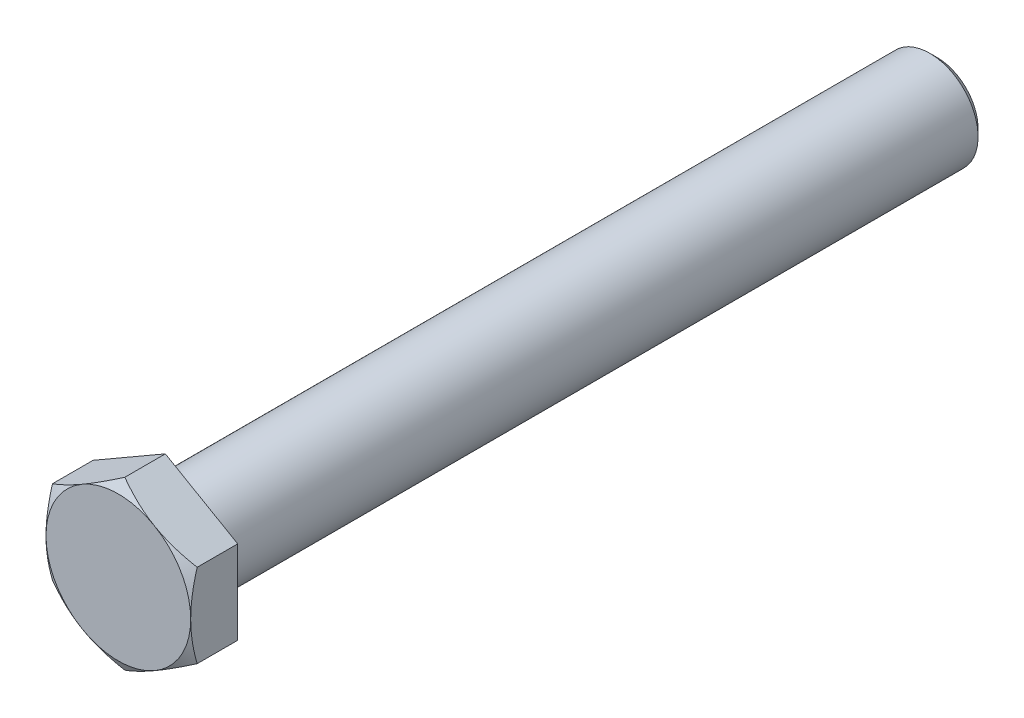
ISO-10303-21;
HEADER;
FILE_DESCRIPTION(('STEP AP214'),'2;1');
FILE_NAME('part.step','',(''),(''),'','','');
FILE_SCHEMA(('AUTOMOTIVE_DESIGN { 1 0 10303 214 1 1 1 1 }'));
ENDSEC;
DATA;
#1=APPLICATION_CONTEXT('core data for automotive mechanical design processes');
#2=APPLICATION_PROTOCOL_DEFINITION('international standard','automotive_design',2000,#1);
#3=PRODUCT_CONTEXT('',#1,'mechanical');
#4=PRODUCT('Part','Part','',(#3));
#5=PRODUCT_RELATED_PRODUCT_CATEGORY('part','',(#4));
#6=PRODUCT_DEFINITION_FORMATION('','',#4);
#7=PRODUCT_DEFINITION_CONTEXT('part definition',#1,'design');
#8=PRODUCT_DEFINITION('design','',#6,#7);
#9=PRODUCT_DEFINITION_SHAPE('','',#8);
#10=(LENGTH_UNIT() NAMED_UNIT(*) SI_UNIT(.MILLI.,.METRE.));
#11=(NAMED_UNIT(*) PLANE_ANGLE_UNIT() SI_UNIT($,.RADIAN.));
#12=(NAMED_UNIT(*) SI_UNIT($,.STERADIAN.) SOLID_ANGLE_UNIT());
#13=UNCERTAINTY_MEASURE_WITH_UNIT(LENGTH_MEASURE(1.E-05),#10,'distance_accuracy_value','');
#14=(GEOMETRIC_REPRESENTATION_CONTEXT(3) GLOBAL_UNCERTAINTY_ASSIGNED_CONTEXT((#13)) GLOBAL_UNIT_ASSIGNED_CONTEXT((#10,
#11,#12)) REPRESENTATION_CONTEXT('',''));
#15=CARTESIAN_POINT('',(0.,0.,0.));
#16=DIRECTION('',(0.,0.,1.));
#17=DIRECTION('',(1.,0.,0.));
#18=AXIS2_PLACEMENT_3D('',#15,#16,#17);
#19=CARTESIAN_POINT('',(0.,-27.4963065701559,46.5125483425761));
#20=DIRECTION('',(0.5,-0.866025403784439,0.));
#21=DIRECTION('',(0.866025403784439,0.5,0.));
#22=AXIS2_PLACEMENT_3D('',#19,#20,#21);
#23=PLANE('',#22);
#24=DIRECTION('',(0.,0.,1.));
#25=VECTOR('',#24,1.);
#26=CARTESIAN_POINT('',(23.8125,-13.748153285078,46.5125483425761));
#27=LINE('',#26,#25);
#28=CARTESIAN_POINT('',(23.8125,-13.748153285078,119.2609375));
#29=VERTEX_POINT('',#28);
#30=CARTESIAN_POINT('',(23.8125,-13.748153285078,132.612215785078));
#31=VERTEX_POINT('',#30);
#32=EDGE_CURVE('E159',#29,#31,#27,.T.);
#33=ORIENTED_EDGE('',*,*,#32,.T.);
#34=CARTESIAN_POINT('',(23.8127,-13.7480378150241,132.612149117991));
#35=CARTESIAN_POINT('',(23.2893115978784,-14.0502162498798,132.78659920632));
#36=CARTESIAN_POINT('',(22.7638817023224,-14.3535733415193,132.953132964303));
#37=CARTESIAN_POINT('',(21.7088085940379,-14.9627200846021,133.2681673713));
#38=CARTESIAN_POINT('',(21.1791640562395,-15.2685105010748,133.416662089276));
#39=CARTESIAN_POINT('',(20.1146267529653,-15.8831213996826,133.693625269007));
#40=CARTESIAN_POINT('',(19.5797245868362,-16.1919473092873,133.822045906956));
#41=CARTESIAN_POINT('',(18.5062261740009,-16.8117319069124,134.05609444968));
#42=CARTESIAN_POINT('',(17.9676303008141,-17.1226903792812,134.16172462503));
#43=CARTESIAN_POINT('',(16.9005114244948,-17.7387917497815,134.345708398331));
#44=CARTESIAN_POINT('',(16.3720675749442,-18.0438889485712,134.424670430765));
#45=CARTESIAN_POINT('',(15.3127585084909,-18.655481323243,134.557071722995));
#46=CARTESIAN_POINT('',(14.7818932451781,-18.9619765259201,134.610510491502));
#47=CARTESIAN_POINT('',(13.719270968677,-19.5754817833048,134.69051595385));
#48=CARTESIAN_POINT('',(13.1875157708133,-19.8824907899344,134.717114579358));
#49=CARTESIAN_POINT('',(12.1235146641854,-20.4967921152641,134.742867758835));
#50=CARTESIAN_POINT('',(11.5912687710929,-20.8040844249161,134.742023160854));
#51=CARTESIAN_POINT('',(10.5962267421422,-21.3785722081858,134.714806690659));
#52=CARTESIAN_POINT('',(10.1333597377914,-21.6458085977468,134.691753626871));
#53=CARTESIAN_POINT('',(9.20873076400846,-22.1796433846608,134.625329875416));
#54=CARTESIAN_POINT('',(8.74696877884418,-22.446241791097,134.58195947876));
#55=CARTESIAN_POINT('',(7.82472045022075,-22.9787021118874,134.475652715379));
#56=CARTESIAN_POINT('',(7.3642356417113,-23.2445631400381,134.412698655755));
#57=CARTESIAN_POINT('',(6.44547090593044,-23.7750122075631,134.268338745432));
#58=CARTESIAN_POINT('',(5.98719096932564,-24.0396002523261,134.18693297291));
#59=CARTESIAN_POINT('',(4.59595069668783,-24.842833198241,133.912948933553));
#60=CARTESIAN_POINT('',(3.66694311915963,-25.3791959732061,133.693036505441));
#61=CARTESIAN_POINT('',(2.28369123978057,-26.1778168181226,133.318645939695));
#62=CARTESIAN_POINT('',(1.82471356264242,-26.4428077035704,133.186563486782));
#63=CARTESIAN_POINT('',(0.909932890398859,-26.9709565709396,132.909026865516));
#64=CARTESIAN_POINT('',(0.454129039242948,-27.2341150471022,132.763576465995));
#65=CARTESIAN_POINT('',(-0.000200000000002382,-27.4964220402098,132.612149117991));
#66=B_SPLINE_CURVE_WITH_KNOTS('',3,(#34,#35,#36,#37,#38,#39,#40,#41,#42,#43,#44,#45,#46,#47,#48,
#49,#50,#51,#52,#53,#54,#55,#56,#57,#58,#59,#60,#61,#62,#63,#64,#65),.UNSPECIFIED.,.F.,.F.,(4,2,
2,2,2,2,2,2,2,2,2,2,2,2,2,4),(0.,1.88714251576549,3.77490383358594,5.66709611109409,
7.55909978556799,9.40444412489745,11.2498239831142,13.093005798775,14.9361306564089,
16.5406522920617,18.1451509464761,19.7511034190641,21.3570490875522,24.6396796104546,
26.2781355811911,27.9161310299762),.UNSPECIFIED.);
#67=CARTESIAN_POINT('',(11.90625,-20.6222299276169,134.7390625));
#68=VERTEX_POINT('',#67);
#69=EDGE_CURVE('E278',#31,#68,#66,.T.);
#70=ORIENTED_EDGE('',*,*,#69,.T.);
#71=CARTESIAN_POINT('',(0.,-27.4963065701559,132.612215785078));
#72=VERTEX_POINT('',#71);
#73=EDGE_CURVE('E202',#68,#72,#66,.T.);
#74=ORIENTED_EDGE('',*,*,#73,.T.);
#75=DIRECTION('',(0.,0.,1.));
#76=VECTOR('',#75,1.);
#77=CARTESIAN_POINT('',(0.,-27.4963065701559,46.5125483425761));
#78=LINE('',#77,#76);
#79=CARTESIAN_POINT('',(0.,-27.4963065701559,119.2609375));
#80=VERTEX_POINT('',#79);
#81=EDGE_CURVE('E303',#80,#72,#78,.T.);
#82=ORIENTED_EDGE('',*,*,#81,.F.);
#83=DIRECTION('',(0.866025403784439,0.5,0.));
#84=VECTOR('',#83,1.);
#85=CARTESIAN_POINT('',(0.,-27.4963065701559,119.2609375));
#86=LINE('',#85,#84);
#87=EDGE_CURVE('E157',#80,#29,#86,.T.);
#88=ORIENTED_EDGE('',*,*,#87,.T.);
#89=EDGE_LOOP('',(#33,#70,#74,#82,#88));
#90=FACE_BOUND('',#89,.T.);
#91=ADVANCED_FACE('F46',(#90),#23,.T.);
#92=CARTESIAN_POINT('',(23.8125,-13.748153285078,46.5125483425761));
#93=DIRECTION('',(1.,0.,0.));
#94=DIRECTION('',(0.,0.,-1.));
#95=AXIS2_PLACEMENT_3D('',#92,#93,#94);
#96=PLANE('',#95);
#97=DIRECTION('',(0.,0.,1.));
#98=VECTOR('',#97,1.);
#99=CARTESIAN_POINT('',(23.8125,13.748153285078,46.5125483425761));
#100=LINE('',#99,#98);
#101=CARTESIAN_POINT('',(23.8125,13.748153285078,119.2609375));
#102=VERTEX_POINT('',#101);
#103=CARTESIAN_POINT('',(23.8125,13.748153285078,132.612215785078));
#104=VERTEX_POINT('',#103);
#105=EDGE_CURVE('E320',#102,#104,#100,.T.);
#106=ORIENTED_EDGE('',*,*,#105,.T.);
#107=CARTESIAN_POINT('',(23.8125,-37.2463217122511,122.963869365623));
#108=CARTESIAN_POINT('',(23.8125,-36.7248950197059,123.217502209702));
#109=CARTESIAN_POINT('',(23.8125,-36.2028645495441,123.469897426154));
#110=CARTESIAN_POINT('',(23.8125,-35.1574708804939,123.971925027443));
#111=CARTESIAN_POINT('',(23.8125,-34.6341076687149,124.221557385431));
#112=CARTESIAN_POINT('',(23.8125,-33.5858549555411,124.717803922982));
#113=CARTESIAN_POINT('',(23.8125,-33.0609652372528,124.964417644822));
#114=CARTESIAN_POINT('',(23.8125,-32.0096028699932,125.454242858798));
#115=CARTESIAN_POINT('',(23.8125,-31.4831302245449,125.6974543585));
#116=CARTESIAN_POINT('',(23.8125,-29.8955348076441,126.42397750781));
#117=CARTESIAN_POINT('',(23.8125,-28.8317732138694,126.901546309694));
#118=CARTESIAN_POINT('',(23.8125,-26.6958950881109,127.837581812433));
#119=CARTESIAN_POINT('',(23.8125,-25.6237789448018,128.296049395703));
#120=CARTESIAN_POINT('',(23.8125,-23.9903137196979,128.972940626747));
#121=CARTESIAN_POINT('',(23.8125,-23.4326424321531,129.200247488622));
#122=CARTESIAN_POINT('',(23.8125,-22.3143641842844,129.647512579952));
#123=CARTESIAN_POINT('',(23.8125,-21.7537572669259,129.867470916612));
#124=CARTESIAN_POINT('',(23.8125,-20.6292564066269,130.299078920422));
#125=CARTESIAN_POINT('',(23.8125,-20.0653620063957,130.510727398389));
#126=CARTESIAN_POINT('',(23.8125,-18.9341081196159,130.92452722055));
#127=CARTESIAN_POINT('',(23.8125,-18.3667487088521,131.126678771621));
#128=CARTESIAN_POINT('',(23.8125,-17.2294024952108,131.519792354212));
#129=CARTESIAN_POINT('',(23.8125,-16.6594230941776,131.710775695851));
#130=CARTESIAN_POINT('',(23.8125,-15.5155155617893,132.080490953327));
#131=CARTESIAN_POINT('',(23.8125,-14.9415873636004,132.25922266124));
#132=CARTESIAN_POINT('',(23.8125,-13.2138318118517,132.774511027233));
#133=CARTESIAN_POINT('',(23.8125,-12.0536072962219,133.090310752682));
#134=CARTESIAN_POINT('',(23.8125,-10.3038688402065,133.510278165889));
#135=CARTESIAN_POINT('',(23.8125,-9.72067055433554,133.641025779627));
#136=CARTESIAN_POINT('',(23.8125,-8.55022632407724,133.883073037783));
#137=CARTESIAN_POINT('',(23.8125,-7.96298045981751,133.994373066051));
#138=CARTESIAN_POINT('',(23.8125,-6.78484275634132,134.195578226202));
#139=CARTESIAN_POINT('',(23.8125,-6.19395106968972,134.285484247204));
#140=CARTESIAN_POINT('',(23.8125,-5.00908317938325,134.442126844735));
#141=CARTESIAN_POINT('',(23.8125,-4.41510697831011,134.508863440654));
#142=CARTESIAN_POINT('',(23.8125,-3.23283276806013,134.616980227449));
#143=CARTESIAN_POINT('',(23.8125,-2.64456480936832,134.658687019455));
#144=CARTESIAN_POINT('',(23.8125,-1.4667922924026,134.717170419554));
#145=CARTESIAN_POINT('',(23.8125,-0.877287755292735,134.73394745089));
#146=CARTESIAN_POINT('',(23.8125,0.301907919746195,134.742170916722));
#147=CARTESIAN_POINT('',(23.8125,0.891599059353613,134.733617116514));
#148=CARTESIAN_POINT('',(23.8125,2.07008842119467,134.691390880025));
#149=CARTESIAN_POINT('',(23.8125,2.65888660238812,134.657717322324));
#150=CARTESIAN_POINT('',(23.8125,4.06417520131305,134.548093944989));
#151=CARTESIAN_POINT('',(23.8125,4.87979460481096,134.460770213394));
#152=CARTESIAN_POINT('',(23.8125,6.50519459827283,134.242600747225));
#153=CARTESIAN_POINT('',(23.8125,7.31497441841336,134.11174937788));
#154=CARTESIAN_POINT('',(23.8125,8.92783755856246,133.811178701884));
#155=CARTESIAN_POINT('',(23.8125,9.73091548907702,133.641430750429));
#156=CARTESIAN_POINT('',(23.8125,11.3291239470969,133.268260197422));
#157=CARTESIAN_POINT('',(23.8125,12.1242545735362,133.064838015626));
#158=CARTESIAN_POINT('',(23.8125,13.7248372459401,132.624262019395));
#159=CARTESIAN_POINT('',(23.8125,14.5301034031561,132.38643753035));
#160=CARTESIAN_POINT('',(23.8125,16.1327036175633,131.885556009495));
#161=CARTESIAN_POINT('',(23.8125,16.9300376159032,131.622498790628));
#162=CARTESIAN_POINT('',(23.8125,18.5171718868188,131.075384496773));
#163=CARTESIAN_POINT('',(23.8125,19.3069743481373,130.791333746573));
#164=CARTESIAN_POINT('',(23.8125,20.4867238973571,130.352066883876));
#165=CARTESIAN_POINT('',(23.8125,20.8791465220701,130.203446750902));
#166=CARTESIAN_POINT('',(23.8125,21.6624430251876,129.902174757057));
#167=CARTESIAN_POINT('',(23.8125,22.0533169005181,129.749522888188));
#168=CARTESIAN_POINT('',(23.8125,23.0793859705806,129.343209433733));
#169=CARTESIAN_POINT('',(23.8125,23.7133734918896,129.086496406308));
#170=CARTESIAN_POINT('',(23.8125,24.9778550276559,128.564590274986));
#171=CARTESIAN_POINT('',(23.8125,25.6083489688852,128.299396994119));
#172=CARTESIAN_POINT('',(23.8125,26.8662295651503,127.761621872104));
#173=CARTESIAN_POINT('',(23.8125,27.4936159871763,127.489039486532));
#174=CARTESIAN_POINT('',(23.8125,28.7455556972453,126.937438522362));
#175=CARTESIAN_POINT('',(23.8125,29.3701089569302,126.658419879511));
#176=CARTESIAN_POINT('',(23.8125,31.2403678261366,125.812758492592));
#177=CARTESIAN_POINT('',(23.8125,32.4822645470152,125.237685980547));
#178=CARTESIAN_POINT('',(23.8125,34.957785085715,124.070192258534));
#179=CARTESIAN_POINT('',(23.8125,36.1914091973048,123.477771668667));
#180=CARTESIAN_POINT('',(23.8125,38.6537975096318,122.27835070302));
#181=CARTESIAN_POINT('',(23.8125,39.8825518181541,121.671330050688));
#182=CARTESIAN_POINT('',(23.8125,42.3345841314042,120.44632415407));
#183=CARTESIAN_POINT('',(23.8125,43.5578620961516,119.828338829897));
#184=CARTESIAN_POINT('',(23.8125,45.9996546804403,118.583620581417));
#185=CARTESIAN_POINT('',(23.8125,47.2181701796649,117.956889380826));
#186=CARTESIAN_POINT('',(23.8125,49.6514328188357,116.696169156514));
#187=CARTESIAN_POINT('',(23.8125,50.8661799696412,116.062180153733));
#188=CARTESIAN_POINT('',(23.8125,53.1699764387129,114.85253135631));
#189=CARTESIAN_POINT('',(23.8125,54.2593287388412,114.277448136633));
#190=CARTESIAN_POINT('',(23.8125,56.435836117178,113.123137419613));
#191=CARTESIAN_POINT('',(23.8125,57.5229911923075,112.543909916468));
#192=CARTESIAN_POINT('',(23.8125,60.781735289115,110.800864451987));
#193=CARTESIAN_POINT('',(23.8125,62.9504888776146,109.63174372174));
#194=CARTESIAN_POINT('',(23.8125,66.1959023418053,107.871961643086));
#195=CARTESIAN_POINT('',(23.8125,67.2747258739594,107.285280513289));
#196=CARTESIAN_POINT('',(23.8125,69.4311082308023,106.109596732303));
#197=CARTESIAN_POINT('',(23.8125,70.5086670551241,105.520594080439));
#198=CARTESIAN_POINT('',(23.8125,72.6625918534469,104.340597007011));
#199=CARTESIAN_POINT('',(23.8125,73.7389579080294,103.749602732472));
#200=CARTESIAN_POINT('',(23.8125,75.8906951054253,102.565808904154));
#201=CARTESIAN_POINT('',(23.8125,76.9660662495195,101.973009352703));
#202=CARTESIAN_POINT('',(23.8125,78.0410012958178,101.379420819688));
#203=B_SPLINE_CURVE_WITH_KNOTS('',3,(#107,#108,#109,#110,#111,#112,#113,#114,#115,#116,#117,
#118,#119,#120,#121,#122,#123,#124,#125,#126,#127,#128,#129,#130,#131,#132,#133,#134,#135,#136,
#137,#138,#139,#140,#141,#142,#143,#144,#145,#146,#147,#148,#149,#150,#151,#152,#153,#154,#155,
#156,#157,#158,#159,#160,#161,#162,#163,#164,#165,#166,#167,#168,#169,#170,#171,#172,#173,#174,
#175,#176,#177,#178,#179,#180,#181,#182,#183,#184,#185,#186,#187,#188,#189,#190,#191,#192,#193,
#194,#195,#196,#197,#198,#199,#200,#201,#202),.UNSPECIFIED.,.F.,.F.,(4,2,2,2,2,2,2,2,2,2,2,2,2,
2,2,2,2,2,2,2,2,2,2,2,2,2,2,2,2,2,2,2,2,2,2,2,2,2,2,2,2,2,2,2,2,2,2,4),(0.,1.73952319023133,
3.47906327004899,5.21886393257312,6.95866072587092,10.4566487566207,13.9544750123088,
15.7610845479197,17.5676677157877,19.3745084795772,21.1813098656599,22.9845429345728,
24.7878065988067,28.3929796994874,30.1857435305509,31.9784719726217,33.7711258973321,
35.5637783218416,37.3324998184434,39.1011912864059,40.8698991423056,42.6386859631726,
45.0981752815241,47.5579831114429,50.0196082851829,52.4812027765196,54.9996623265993,
57.5181405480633,60.0358630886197,61.2947144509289,62.553568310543,64.6054608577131,
66.6573962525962,68.70948324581,70.7615907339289,74.8671380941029,78.9725388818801,
83.0840144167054,87.1955199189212,91.3062262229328,95.4169206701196,99.1124053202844,
102.807895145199,110.199262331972,113.883347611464,117.56743395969,121.251254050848,
124.935069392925),.UNSPECIFIED.);
#204=CARTESIAN_POINT('',(23.8125,0.,134.7390625));
#205=VERTEX_POINT('',#204);
#206=EDGE_CURVE('E121',#104,#205,#203,.F.);
#207=ORIENTED_EDGE('',*,*,#206,.T.);
#208=EDGE_CURVE('E170',#205,#31,#203,.F.);
#209=ORIENTED_EDGE('',*,*,#208,.T.);
#210=ORIENTED_EDGE('',*,*,#32,.F.);
#211=DIRECTION('',(0.,1.,0.));
#212=VECTOR('',#211,1.);
#213=CARTESIAN_POINT('',(23.8125,-13.748153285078,119.2609375));
#214=LINE('',#213,#212);
#215=EDGE_CURVE('E308',#29,#102,#214,.T.);
#216=ORIENTED_EDGE('',*,*,#215,.T.);
#217=EDGE_LOOP('',(#106,#207,#209,#210,#216));
#218=FACE_BOUND('',#217,.T.);
#219=ADVANCED_FACE('F232',(#218),#96,.T.);
#220=CARTESIAN_POINT('',(23.8125,13.748153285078,46.5125483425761));
#221=DIRECTION('',(0.5,0.866025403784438,0.));
#222=DIRECTION('',(-0.866025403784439,0.5,0.));
#223=AXIS2_PLACEMENT_3D('',#220,#221,#222);
#224=PLANE('',#223);
#225=DIRECTION('',(0.,0.,1.));
#226=VECTOR('',#225,1.);
#227=CARTESIAN_POINT('',(0.,27.4963065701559,46.5125483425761));
#228=LINE('',#227,#226);
#229=CARTESIAN_POINT('',(0.,27.4963065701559,119.2609375));
#230=VERTEX_POINT('',#229);
#231=CARTESIAN_POINT('',(0.,27.4963065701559,132.612215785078));
#232=VERTEX_POINT('',#231);
#233=EDGE_CURVE('E151',#230,#232,#228,.T.);
#234=ORIENTED_EDGE('',*,*,#233,.T.);
#235=CARTESIAN_POINT('',(-0.000199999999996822,27.4964220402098,132.612149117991));
#236=CARTESIAN_POINT('',(0.523188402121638,27.1942436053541,132.78659920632));
#237=CARTESIAN_POINT('',(1.04861829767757,26.8908865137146,132.953132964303));
#238=CARTESIAN_POINT('',(2.10369140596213,26.2817397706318,133.2681673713));
#239=CARTESIAN_POINT('',(2.63333594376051,25.9759493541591,133.416662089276));
#240=CARTESIAN_POINT('',(3.69787324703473,25.3613384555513,133.693625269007));
#241=CARTESIAN_POINT('',(4.23277541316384,25.0525125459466,133.822045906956));
#242=CARTESIAN_POINT('',(5.30627382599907,24.4327279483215,134.05609444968));
#243=CARTESIAN_POINT('',(5.84486969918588,24.1217694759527,134.16172462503));
#244=CARTESIAN_POINT('',(6.91198857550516,23.5056681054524,134.345708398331));
#245=CARTESIAN_POINT('',(7.44043242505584,23.2005709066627,134.424670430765));
#246=CARTESIAN_POINT('',(8.49974149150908,22.5889785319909,134.557071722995));
#247=CARTESIAN_POINT('',(9.03060675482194,22.2824833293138,134.610510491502));
#248=CARTESIAN_POINT('',(10.093229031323,21.6689780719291,134.69051595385));
#249=CARTESIAN_POINT('',(10.6249842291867,21.3619690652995,134.717114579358));
#250=CARTESIAN_POINT('',(11.6889853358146,20.7476677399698,134.742867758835));
#251=CARTESIAN_POINT('',(12.2212312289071,20.4403754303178,134.742023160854));
#252=CARTESIAN_POINT('',(13.2162732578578,19.8658876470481,134.714806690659));
#253=CARTESIAN_POINT('',(13.6791402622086,19.5986512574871,134.691753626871));
#254=CARTESIAN_POINT('',(14.6037692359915,19.064816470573,134.625329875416));
#255=CARTESIAN_POINT('',(15.0655312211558,18.7982180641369,134.58195947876));
#256=CARTESIAN_POINT('',(15.9877795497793,18.2657577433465,134.475652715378));
#257=CARTESIAN_POINT('',(16.4482643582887,17.9998967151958,134.412698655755));
#258=CARTESIAN_POINT('',(17.3670290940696,17.4694476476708,134.268338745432));
#259=CARTESIAN_POINT('',(17.8253090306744,17.2048596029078,134.18693297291));
#260=CARTESIAN_POINT('',(19.2165493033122,16.4016266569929,133.912948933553));
#261=CARTESIAN_POINT('',(20.1455568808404,15.8652638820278,133.693036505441));
#262=CARTESIAN_POINT('',(21.5288087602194,15.0666430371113,133.318645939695));
#263=CARTESIAN_POINT('',(21.9877864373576,14.8016521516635,133.186563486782));
#264=CARTESIAN_POINT('',(22.9025671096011,14.2735032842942,132.909026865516));
#265=CARTESIAN_POINT('',(23.358370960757,14.0103448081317,132.763576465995));
#266=CARTESIAN_POINT('',(23.8127,13.7480378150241,132.612149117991));
#267=B_SPLINE_CURVE_WITH_KNOTS('',3,(#235,#236,#237,#238,#239,#240,#241,#242,#243,#244,#245,
#246,#247,#248,#249,#250,#251,#252,#253,#254,#255,#256,#257,#258,#259,#260,#261,#262,#263,#264,
#265,#266),.UNSPECIFIED.,.F.,.F.,(4,2,2,2,2,2,2,2,2,2,2,2,2,2,2,4),(0.,1.88714251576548,
3.77490383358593,5.66709611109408,7.55909978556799,9.40444412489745,11.2498239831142,
13.093005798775,14.9361306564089,16.5406522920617,18.1451509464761,19.7511034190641,
21.3570490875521,24.6396796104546,26.2781355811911,27.9161310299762),.UNSPECIFIED.);
#268=CARTESIAN_POINT('',(11.90625,20.6222299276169,134.7390625));
#269=VERTEX_POINT('',#268);
#270=EDGE_CURVE('E130',#232,#269,#267,.T.);
#271=ORIENTED_EDGE('',*,*,#270,.T.);
#272=EDGE_CURVE('E120',#269,#104,#267,.T.);
#273=ORIENTED_EDGE('',*,*,#272,.T.);
#274=ORIENTED_EDGE('',*,*,#105,.F.);
#275=DIRECTION('',(-0.866025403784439,0.5,0.));
#276=VECTOR('',#275,1.);
#277=CARTESIAN_POINT('',(23.8125,13.748153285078,119.2609375));
#278=LINE('',#277,#276);
#279=EDGE_CURVE('E319',#102,#230,#278,.T.);
#280=ORIENTED_EDGE('',*,*,#279,.T.);
#281=EDGE_LOOP('',(#234,#271,#273,#274,#280));
#282=FACE_BOUND('',#281,.T.);
#283=ADVANCED_FACE('F152',(#282),#224,.T.);
#284=CARTESIAN_POINT('',(0.,27.4963065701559,46.5125483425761));
#285=DIRECTION('',(-0.5,0.866025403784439,0.));
#286=DIRECTION('',(-0.866025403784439,-0.5,0.));
#287=AXIS2_PLACEMENT_3D('',#284,#285,#286);
#288=PLANE('',#287);
#289=DIRECTION('',(0.,0.,1.));
#290=VECTOR('',#289,1.);
#291=CARTESIAN_POINT('',(-23.8125,13.748153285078,46.5125483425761));
#292=LINE('',#291,#290);
#293=CARTESIAN_POINT('',(-23.8125,13.748153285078,119.2609375));
#294=VERTEX_POINT('',#293);
#295=CARTESIAN_POINT('',(-23.8125,13.748153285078,132.612215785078));
#296=VERTEX_POINT('',#295);
#297=EDGE_CURVE('E307',#294,#296,#292,.T.);
#298=ORIENTED_EDGE('',*,*,#297,.T.);
#299=CARTESIAN_POINT('',(-23.8127,13.7480378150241,132.612149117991));
#300=CARTESIAN_POINT('',(-23.2893115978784,14.0502162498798,132.78659920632));
#301=CARTESIAN_POINT('',(-22.7638817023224,14.3535733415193,132.953132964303));
#302=CARTESIAN_POINT('',(-21.7088085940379,14.9627200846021,133.2681673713));
#303=CARTESIAN_POINT('',(-21.1791640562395,15.2685105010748,133.416662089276));
#304=CARTESIAN_POINT('',(-20.1146267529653,15.8831213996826,133.693625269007));
#305=CARTESIAN_POINT('',(-19.5797245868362,16.1919473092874,133.822045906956));
#306=CARTESIAN_POINT('',(-18.5062261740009,16.8117319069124,134.05609444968));
#307=CARTESIAN_POINT('',(-17.9676303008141,17.1226903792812,134.16172462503));
#308=CARTESIAN_POINT('',(-16.9005114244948,17.7387917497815,134.345708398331));
#309=CARTESIAN_POINT('',(-16.3720675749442,18.0438889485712,134.424670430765));
#310=CARTESIAN_POINT('',(-15.3127585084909,18.655481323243,134.557071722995));
#311=CARTESIAN_POINT('',(-14.7818932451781,18.9619765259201,134.610510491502));
#312=CARTESIAN_POINT('',(-13.719270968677,19.5754817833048,134.69051595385));
#313=CARTESIAN_POINT('',(-13.1875157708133,19.8824907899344,134.717114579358));
#314=CARTESIAN_POINT('',(-12.1235146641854,20.4967921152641,134.742867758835));
#315=CARTESIAN_POINT('',(-11.5912687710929,20.8040844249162,134.742023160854));
#316=CARTESIAN_POINT('',(-10.5962267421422,21.3785722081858,134.714806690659));
#317=CARTESIAN_POINT('',(-10.1333597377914,21.6458085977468,134.691753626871));
#318=CARTESIAN_POINT('',(-9.20873076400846,22.1796433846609,134.625329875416));
#319=CARTESIAN_POINT('',(-8.74696877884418,22.446241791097,134.58195947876));
#320=CARTESIAN_POINT('',(-7.82472045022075,22.9787021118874,134.475652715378));
#321=CARTESIAN_POINT('',(-7.3642356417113,23.2445631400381,134.412698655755));
#322=CARTESIAN_POINT('',(-6.44547090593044,23.7750122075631,134.268338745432));
#323=CARTESIAN_POINT('',(-5.98719096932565,24.0396002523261,134.18693297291));
#324=CARTESIAN_POINT('',(-4.59595069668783,24.842833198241,133.912948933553));
#325=CARTESIAN_POINT('',(-3.66694311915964,25.3791959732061,133.693036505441));
#326=CARTESIAN_POINT('',(-2.28369123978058,26.1778168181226,133.318645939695));
#327=CARTESIAN_POINT('',(-1.82471356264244,26.4428077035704,133.186563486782));
#328=CARTESIAN_POINT('',(-0.909932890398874,26.9709565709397,132.909026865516));
#329=CARTESIAN_POINT('',(-0.45412903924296,27.2341150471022,132.763576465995));
#330=CARTESIAN_POINT('',(0.000199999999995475,27.4964220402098,132.612149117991));
#331=B_SPLINE_CURVE_WITH_KNOTS('',3,(#299,#300,#301,#302,#303,#304,#305,#306,#307,#308,#309,
#310,#311,#312,#313,#314,#315,#316,#317,#318,#319,#320,#321,#322,#323,#324,#325,#326,#327,#328,
#329,#330),.UNSPECIFIED.,.F.,.F.,(4,2,2,2,2,2,2,2,2,2,2,2,2,2,2,4),(0.,1.88714251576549,
3.77490383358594,5.66709611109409,7.55909978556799,9.40444412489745,11.2498239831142,
13.093005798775,14.9361306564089,16.5406522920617,18.1451509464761,19.7511034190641,
21.3570490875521,24.6396796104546,26.278135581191,27.9161310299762),.UNSPECIFIED.);
#332=CARTESIAN_POINT('',(-11.90625,20.6222299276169,134.7390625));
#333=VERTEX_POINT('',#332);
#334=EDGE_CURVE('E206',#296,#333,#331,.T.);
#335=ORIENTED_EDGE('',*,*,#334,.T.);
#336=EDGE_CURVE('E127',#333,#232,#331,.T.);
#337=ORIENTED_EDGE('',*,*,#336,.T.);
#338=ORIENTED_EDGE('',*,*,#233,.F.);
#339=DIRECTION('',(-0.866025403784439,-0.5,0.));
#340=VECTOR('',#339,1.);
#341=CARTESIAN_POINT('',(0.,27.4963065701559,119.2609375));
#342=LINE('',#341,#340);
#343=EDGE_CURVE('E311',#230,#294,#342,.T.);
#344=ORIENTED_EDGE('',*,*,#343,.T.);
#345=EDGE_LOOP('',(#298,#335,#337,#338,#344));
#346=FACE_BOUND('',#345,.T.);
#347=ADVANCED_FACE('F217',(#346),#288,.T.);
#348=CARTESIAN_POINT('',(-23.8125,13.748153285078,46.5125483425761));
#349=DIRECTION('',(-1.,0.,0.));
#350=DIRECTION('',(0.,-1.,0.));
#351=AXIS2_PLACEMENT_3D('',#348,#349,#350);
#352=PLANE('',#351);
#353=DIRECTION('',(0.,0.,1.));
#354=VECTOR('',#353,1.);
#355=CARTESIAN_POINT('',(-23.8125,-13.748153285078,46.5125483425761));
#356=LINE('',#355,#354);
#357=CARTESIAN_POINT('',(-23.8125,-13.748153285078,119.2609375));
#358=VERTEX_POINT('',#357);
#359=CARTESIAN_POINT('',(-23.8125,-13.748153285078,132.612215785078));
#360=VERTEX_POINT('',#359);
#361=EDGE_CURVE('E286',#358,#360,#356,.T.);
#362=ORIENTED_EDGE('',*,*,#361,.T.);
#363=CARTESIAN_POINT('',(-23.8125,-37.2463217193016,122.963869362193));
#364=CARTESIAN_POINT('',(-23.8125,-36.7248950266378,123.217502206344));
#365=CARTESIAN_POINT('',(-23.8125,-36.2028645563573,123.469897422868));
#366=CARTESIAN_POINT('',(-23.8125,-35.1574708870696,123.9719250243));
#367=CARTESIAN_POINT('',(-23.8125,-34.6341076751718,124.221557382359));
#368=CARTESIAN_POINT('',(-23.8125,-33.5858549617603,124.717803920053));
#369=CARTESIAN_POINT('',(-23.8125,-33.060965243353,124.964417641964));
#370=CARTESIAN_POINT('',(-23.8125,-32.0096028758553,125.454242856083));
#371=CARTESIAN_POINT('',(-23.8125,-31.4831302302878,125.697454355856));
#372=CARTESIAN_POINT('',(-23.8125,-29.8955348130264,126.42397750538));
#373=CARTESIAN_POINT('',(-23.8125,-28.8317732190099,126.901546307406));
#374=CARTESIAN_POINT('',(-23.8125,-26.6958950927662,127.837581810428));
#375=CARTESIAN_POINT('',(-23.8125,-25.6237789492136,128.296049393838));
#376=CARTESIAN_POINT('',(-23.8125,-23.9903137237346,128.972940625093));
#377=CARTESIAN_POINT('',(-23.8125,-23.432642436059,129.200247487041));
#378=CARTESIAN_POINT('',(-23.8125,-22.314364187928,129.647512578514));
#379=CARTESIAN_POINT('',(-23.8125,-21.753757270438,129.867470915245));
#380=CARTESIAN_POINT('',(-23.8125,-20.6292564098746,130.299078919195));
#381=CARTESIAN_POINT('',(-23.8125,-20.0653620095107,130.51072739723));
#382=CARTESIAN_POINT('',(-23.8125,-18.9341081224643,130.924527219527));
#383=CARTESIAN_POINT('',(-23.8125,-18.3667487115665,131.126678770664));
#384=CARTESIAN_POINT('',(-23.8125,-17.2294024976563,131.519792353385));
#385=CARTESIAN_POINT('',(-23.8125,-16.6594230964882,131.710775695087));
#386=CARTESIAN_POINT('',(-23.8125,-15.5155155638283,132.080490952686));
#387=CARTESIAN_POINT('',(-23.8125,-14.9415873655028,132.259222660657));
#388=CARTESIAN_POINT('',(-23.8125,-13.2138318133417,132.77451102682));
#389=CARTESIAN_POINT('',(-23.8125,-12.053607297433,133.090310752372));
#390=CARTESIAN_POINT('',(-23.8125,-10.3038688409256,133.510278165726));
#391=CARTESIAN_POINT('',(-23.8125,-9.72067055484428,133.641025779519));
#392=CARTESIAN_POINT('',(-23.8125,-8.55022632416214,133.883073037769));
#393=CARTESIAN_POINT('',(-23.8125,-7.96298045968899,133.994373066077));
#394=CARTESIAN_POINT('',(-23.8125,-6.78484275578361,134.195578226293));
#395=CARTESIAN_POINT('',(-23.8125,-6.19395106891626,134.28548424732));
#396=CARTESIAN_POINT('',(-23.8125,-5.00908317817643,134.442126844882));
#397=CARTESIAN_POINT('',(-23.8125,-4.41510697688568,134.508863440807));
#398=CARTESIAN_POINT('',(-23.8125,-3.232832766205,134.616980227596));
#399=CARTESIAN_POINT('',(-23.8125,-2.64456480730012,134.65868701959));
#400=CARTESIAN_POINT('',(-23.8125,-1.46679228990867,134.717170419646));
#401=CARTESIAN_POINT('',(-23.8125,-0.877287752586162,134.73394745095));
#402=CARTESIAN_POINT('',(-23.8125,0.301907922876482,134.742170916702));
#403=CARTESIAN_POINT('',(-23.8125,0.891599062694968,134.733617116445));
#404=CARTESIAN_POINT('',(-23.8125,2.07008842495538,134.69139087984));
#405=CARTESIAN_POINT('',(-23.8125,2.65888660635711,134.657717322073));
#406=CARTESIAN_POINT('',(-23.8125,4.06417520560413,134.548093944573));
#407=CARTESIAN_POINT('',(-23.8125,4.87979460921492,134.460770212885));
#408=CARTESIAN_POINT('',(-23.8125,6.50519460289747,134.242600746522));
#409=CARTESIAN_POINT('',(-23.8125,7.31497442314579,134.111749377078));
#410=CARTESIAN_POINT('',(-23.8125,8.9278375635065,133.811178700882));
#411=CARTESIAN_POINT('',(-23.8125,9.73091549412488,133.641430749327));
#412=CARTESIAN_POINT('',(-23.8125,11.3291239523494,133.268260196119));
#413=CARTESIAN_POINT('',(-23.8125,12.1242545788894,133.064838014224));
#414=CARTESIAN_POINT('',(-23.8125,13.7248372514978,132.624262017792));
#415=CARTESIAN_POINT('',(-23.8125,14.5301034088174,132.386437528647));
#416=CARTESIAN_POINT('',(-23.8125,16.1327036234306,131.885556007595));
#417=CARTESIAN_POINT('',(-23.8125,16.9300376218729,131.62249878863));
#418=CARTESIAN_POINT('',(-23.8125,18.5171718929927,131.075384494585));
#419=CARTESIAN_POINT('',(-23.8125,19.3069743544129,130.79133374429));
#420=CARTESIAN_POINT('',(-23.8125,20.4867239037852,130.352066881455));
#421=CARTESIAN_POINT('',(-23.8125,20.8791465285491,130.203446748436));
#422=CARTESIAN_POINT('',(-23.8125,21.6624430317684,129.9021747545));
#423=CARTESIAN_POINT('',(-23.8125,22.0533169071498,129.749522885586));
#424=CARTESIAN_POINT('',(-23.8125,23.0793859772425,129.343209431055));
#425=CARTESIAN_POINT('',(-23.8125,23.7133734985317,129.086496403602));
#426=CARTESIAN_POINT('',(-23.8125,24.9778550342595,128.564590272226));
#427=CARTESIAN_POINT('',(-23.8125,25.6083489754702,128.299396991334));
#428=CARTESIAN_POINT('',(-23.8125,26.8662295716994,127.761621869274));
#429=CARTESIAN_POINT('',(-23.8125,27.4936159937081,127.489039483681));
#430=CARTESIAN_POINT('',(-23.8125,28.7455557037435,126.937438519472));
#431=CARTESIAN_POINT('',(-23.8125,29.3701089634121,126.658419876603));
#432=CARTESIAN_POINT('',(-23.8125,31.2403678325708,125.812758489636));
#433=CARTESIAN_POINT('',(-23.8125,32.4822645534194,125.237685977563));
#434=CARTESIAN_POINT('',(-23.8125,34.9577850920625,124.070192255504));
#435=CARTESIAN_POINT('',(-23.8125,36.1914092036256,123.477771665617));
#436=CARTESIAN_POINT('',(-23.8125,38.6537975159,122.278350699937));
#437=CARTESIAN_POINT('',(-23.8125,39.8825518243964,121.671330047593));
#438=CARTESIAN_POINT('',(-23.8125,42.3345841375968,120.446324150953));
#439=CARTESIAN_POINT('',(-23.8125,43.5578621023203,119.828338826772));
#440=CARTESIAN_POINT('',(-23.8125,45.9996546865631,118.583620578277));
#441=CARTESIAN_POINT('',(-23.8125,47.2181701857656,117.956889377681));
#442=CARTESIAN_POINT('',(-23.8125,49.6514328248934,116.69616915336));
#443=CARTESIAN_POINT('',(-23.8125,50.8661799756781,116.062180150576));
#444=CARTESIAN_POINT('',(-23.8125,53.1699764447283,114.85253135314));
#445=CARTESIAN_POINT('',(-23.8125,54.259328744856,114.277448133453));
#446=CARTESIAN_POINT('',(-23.8125,56.4358361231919,113.123137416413));
#447=CARTESIAN_POINT('',(-23.8125,57.5229911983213,112.54390991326));
#448=CARTESIAN_POINT('',(-23.8125,60.781735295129,110.800864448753));
#449=CARTESIAN_POINT('',(-23.8125,62.9504888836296,109.631743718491));
#450=CARTESIAN_POINT('',(-23.8125,66.1959023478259,107.871961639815));
#451=CARTESIAN_POINT('',(-23.8125,67.2747258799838,107.28528051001));
#452=CARTESIAN_POINT('',(-23.8125,69.4311082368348,106.109596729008));
#453=CARTESIAN_POINT('',(-23.8125,70.5086670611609,105.520594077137));
#454=CARTESIAN_POINT('',(-23.8125,72.6625918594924,104.340597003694));
#455=CARTESIAN_POINT('',(-23.8125,73.7389579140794,103.749602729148));
#456=CARTESIAN_POINT('',(-23.8125,75.8906951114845,102.565808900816));
#457=CARTESIAN_POINT('',(-23.8125,76.9660662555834,101.973009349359));
#458=CARTESIAN_POINT('',(-23.8125,78.0410013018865,101.379420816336));
#459=B_SPLINE_CURVE_WITH_KNOTS('',3,(#363,#364,#365,#366,#367,#368,#369,#370,#371,#372,#373,
#374,#375,#376,#377,#378,#379,#380,#381,#382,#383,#384,#385,#386,#387,#388,#389,#390,#391,#392,
#393,#394,#395,#396,#397,#398,#399,#400,#401,#402,#403,#404,#405,#406,#407,#408,#409,#410,#411,
#412,#413,#414,#415,#416,#417,#418,#419,#420,#421,#422,#423,#424,#425,#426,#427,#428,#429,#430,
#431,#432,#433,#434,#435,#436,#437,#438,#439,#440,#441,#442,#443,#444,#445,#446,#447,#448,#449,
#450,#451,#452,#453,#454,#455,#456,#457,#458),.UNSPECIFIED.,.F.,.F.,(4,2,2,2,2,2,2,2,2,2,2,2,2,
2,2,2,2,2,2,2,2,2,2,2,2,2,2,2,2,2,2,2,2,2,2,2,2,2,2,2,2,2,2,2,2,2,2,4),(0.,1.73952319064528,
3.47906327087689,5.21886393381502,6.95866072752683,10.4566487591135,13.9544750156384,
15.7610845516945,17.5676677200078,19.3745084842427,21.1813098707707,22.9845429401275,
24.7878066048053,28.392979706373,30.1857435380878,31.9784719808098,33.7711259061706,
35.5637783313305,37.3324998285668,39.1011912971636,40.8698991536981,42.6386859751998,
45.0981752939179,47.5579831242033,50.0196082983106,52.4812027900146,54.9996623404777,
57.518140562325,60.0358631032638,61.2947144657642,62.5535683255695,64.605460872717,
66.6573962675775,68.7094832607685,70.7615907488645,74.8671381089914,78.9725388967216,
83.0840144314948,87.1955199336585,91.3062262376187,95.4169206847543,99.1124053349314,
102.807895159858,110.199262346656,113.88334762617,117.567433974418,121.251254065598,
124.935069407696),.UNSPECIFIED.);
#460=CARTESIAN_POINT('',(-23.8125,0.,134.7390625));
#461=VERTEX_POINT('',#460);
#462=EDGE_CURVE('E68',#360,#461,#459,.T.);
#463=ORIENTED_EDGE('',*,*,#462,.T.);
#464=EDGE_CURVE('E213',#461,#296,#459,.T.);
#465=ORIENTED_EDGE('',*,*,#464,.T.);
#466=ORIENTED_EDGE('',*,*,#297,.F.);
#467=DIRECTION('',(0.,-1.,0.));
#468=VECTOR('',#467,1.);
#469=CARTESIAN_POINT('',(-23.8125,13.748153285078,119.2609375));
#470=LINE('',#469,#468);
#471=EDGE_CURVE('E302',#294,#358,#470,.T.);
#472=ORIENTED_EDGE('',*,*,#471,.T.);
#473=EDGE_LOOP('',(#362,#463,#465,#466,#472));
#474=FACE_BOUND('',#473,.T.);
#475=ADVANCED_FACE('F216',(#474),#352,.T.);
#476=CARTESIAN_POINT('',(-23.8125,-13.748153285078,46.5125483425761));
#477=DIRECTION('',(-0.5,-0.866025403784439,0.));
#478=DIRECTION('',(0.866025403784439,-0.5,0.));
#479=AXIS2_PLACEMENT_3D('',#476,#477,#478);
#480=PLANE('',#479);
#481=ORIENTED_EDGE('',*,*,#81,.T.);
#482=CARTESIAN_POINT('',(0.000199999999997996,-27.4964220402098,132.612149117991));
#483=CARTESIAN_POINT('',(-0.523188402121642,-27.1942436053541,132.78659920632));
#484=CARTESIAN_POINT('',(-1.04861829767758,-26.8908865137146,132.953132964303));
#485=CARTESIAN_POINT('',(-2.10369140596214,-26.2817397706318,133.2681673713));
#486=CARTESIAN_POINT('',(-2.63333594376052,-25.9759493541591,133.416662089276));
#487=CARTESIAN_POINT('',(-3.69787324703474,-25.3613384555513,133.693625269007));
#488=CARTESIAN_POINT('',(-4.23277541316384,-25.0525125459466,133.822045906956));
#489=CARTESIAN_POINT('',(-5.30627382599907,-24.4327279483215,134.05609444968));
#490=CARTESIAN_POINT('',(-5.84486969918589,-24.1217694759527,134.16172462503));
#491=CARTESIAN_POINT('',(-6.91198857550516,-23.5056681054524,134.345708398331));
#492=CARTESIAN_POINT('',(-7.44043242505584,-23.2005709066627,134.424670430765));
#493=CARTESIAN_POINT('',(-8.49974149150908,-22.5889785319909,134.557071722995));
#494=CARTESIAN_POINT('',(-9.03060675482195,-22.2824833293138,134.610510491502));
#495=CARTESIAN_POINT('',(-10.093229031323,-21.6689780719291,134.69051595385));
#496=CARTESIAN_POINT('',(-10.6249842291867,-21.3619690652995,134.717114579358));
#497=CARTESIAN_POINT('',(-11.6889853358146,-20.7476677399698,134.742867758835));
#498=CARTESIAN_POINT('',(-12.2212312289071,-20.4403754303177,134.742023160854));
#499=CARTESIAN_POINT('',(-13.2162732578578,-19.8658876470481,134.714806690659));
#500=CARTESIAN_POINT('',(-13.6791402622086,-19.5986512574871,134.691753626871));
#501=CARTESIAN_POINT('',(-14.6037692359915,-19.064816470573,134.625329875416));
#502=CARTESIAN_POINT('',(-15.0655312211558,-18.7982180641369,134.58195947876));
#503=CARTESIAN_POINT('',(-15.9877795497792,-18.2657577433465,134.475652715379));
#504=CARTESIAN_POINT('',(-16.4482643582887,-17.9998967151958,134.412698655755));
#505=CARTESIAN_POINT('',(-17.3670290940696,-17.4694476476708,134.268338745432));
#506=CARTESIAN_POINT('',(-17.8253090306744,-17.2048596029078,134.18693297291));
#507=CARTESIAN_POINT('',(-19.2165493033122,-16.4016266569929,133.912948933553));
#508=CARTESIAN_POINT('',(-20.1455568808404,-15.8652638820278,133.693036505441));
#509=CARTESIAN_POINT('',(-21.5288087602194,-15.0666430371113,133.318645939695));
#510=CARTESIAN_POINT('',(-21.9877864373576,-14.8016521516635,133.186563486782));
#511=CARTESIAN_POINT('',(-22.9025671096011,-14.2735032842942,132.909026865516));
#512=CARTESIAN_POINT('',(-23.358370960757,-14.0103448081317,132.763576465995));
#513=CARTESIAN_POINT('',(-23.8127,-13.7480378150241,132.612149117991));
#514=B_SPLINE_CURVE_WITH_KNOTS('',3,(#482,#483,#484,#485,#486,#487,#488,#489,#490,#491,#492,
#493,#494,#495,#496,#497,#498,#499,#500,#501,#502,#503,#504,#505,#506,#507,#508,#509,#510,#511,
#512,#513),.UNSPECIFIED.,.F.,.F.,(4,2,2,2,2,2,2,2,2,2,2,2,2,2,2,4),(0.,1.88714251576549,
3.77490383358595,5.66709611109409,7.55909978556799,9.40444412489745,11.2498239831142,
13.093005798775,14.9361306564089,16.5406522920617,18.1451509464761,19.7511034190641,
21.3570490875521,24.6396796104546,26.2781355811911,27.9161310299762),.UNSPECIFIED.);
#515=CARTESIAN_POINT('',(-11.90625,-20.6222299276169,134.7390625));
#516=VERTEX_POINT('',#515);
#517=EDGE_CURVE('E292',#72,#516,#514,.T.);
#518=ORIENTED_EDGE('',*,*,#517,.T.);
#519=EDGE_CURVE('E146',#516,#360,#514,.T.);
#520=ORIENTED_EDGE('',*,*,#519,.T.);
#521=ORIENTED_EDGE('',*,*,#361,.F.);
#522=DIRECTION('',(0.866025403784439,-0.5,0.));
#523=VECTOR('',#522,1.);
#524=CARTESIAN_POINT('',(-23.8125,-13.748153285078,119.2609375));
#525=LINE('',#524,#523);
#526=EDGE_CURVE('E296',#358,#80,#525,.T.);
#527=ORIENTED_EDGE('',*,*,#526,.T.);
#528=EDGE_LOOP('',(#481,#518,#520,#521,#527));
#529=FACE_BOUND('',#528,.T.);
#530=ADVANCED_FACE('F185',(#529),#480,.T.);
#531=CARTESIAN_POINT('',(0.,23.8125,119.2609375));
#532=DIRECTION('',(0.,0.,-1.));
#533=DIRECTION('',(-1.,0.,0.));
#534=AXIS2_PLACEMENT_3D('',#531,#532,#533);
#535=PLANE('',#534);
#536=CARTESIAN_POINT('',(0.,0.,119.2609375));
#537=DIRECTION('',(0.,0.,-1.));
#538=DIRECTION('',(-1.,0.,0.));
#539=AXIS2_PLACEMENT_3D('',#536,#537,#538);
#540=CIRCLE('',#539,16.51);
#541=CARTESIAN_POINT('',(-16.51,0.,119.2609375));
#542=VERTEX_POINT('',#541);
#543=EDGE_CURVE('E12',#542,#542,#540,.F.);
#544=ORIENTED_EDGE('',*,*,#543,.T.);
#545=EDGE_LOOP('',(#544));
#546=FACE_BOUND('',#545,.T.);
#547=ORIENTED_EDGE('',*,*,#526,.F.);
#548=ORIENTED_EDGE('',*,*,#471,.F.);
#549=ORIENTED_EDGE('',*,*,#343,.F.);
#550=ORIENTED_EDGE('',*,*,#279,.F.);
#551=ORIENTED_EDGE('',*,*,#215,.F.);
#552=ORIENTED_EDGE('',*,*,#87,.F.);
#553=EDGE_LOOP('',(#547,#548,#549,#550,#551,#552));
#554=FACE_BOUND('',#553,.T.);
#555=ADVANCED_FACE('F230',(#546,#554),#535,.T.);
#556=CARTESIAN_POINT('',(0.,0.,-134.7390625));
#557=DIRECTION('',(0.,0.,-1.));
#558=DIRECTION('',(-1.,0.,0.));
#559=AXIS2_PLACEMENT_3D('',#556,#557,#558);
#560=CYLINDRICAL_SURFACE('',#559,15.875);
#561=CARTESIAN_POINT('',(0.,0.,118.6259375));
#562=DIRECTION('',(0.,0.,-1.));
#563=DIRECTION('',(-1.,0.,0.));
#564=AXIS2_PLACEMENT_3D('',#561,#562,#563);
#565=CIRCLE('',#564,15.875);
#566=CARTESIAN_POINT('',(-15.875,0.,118.6259375));
#567=VERTEX_POINT('',#566);
#568=EDGE_CURVE('E54',#567,#567,#565,.T.);
#569=ORIENTED_EDGE('',*,*,#568,.T.);
#570=EDGE_LOOP('',(#569));
#571=FACE_BOUND('',#570,.T.);
#572=CARTESIAN_POINT('',(0.,0.,-132.3578125));
#573=DIRECTION('',(0.,0.,-1.));
#574=DIRECTION('',(-1.,0.,0.));
#575=AXIS2_PLACEMENT_3D('',#572,#573,#574);
#576=CIRCLE('',#575,15.8750000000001);
#577=CARTESIAN_POINT('',(-15.8750000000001,0.,-132.3578125));
#578=VERTEX_POINT('',#577);
#579=EDGE_CURVE('E326',#578,#578,#576,.T.);
#580=ORIENTED_EDGE('',*,*,#579,.F.);
#581=EDGE_LOOP('',(#580));
#582=FACE_BOUND('',#581,.T.);
#583=ADVANCED_FACE('F249',(#571,#582),#560,.T.);
#584=CARTESIAN_POINT('',(0.,0.,-134.7390625));
#585=DIRECTION('',(0.,0.,1.));
#586=DIRECTION('',(1.,0.,0.));
#587=AXIS2_PLACEMENT_3D('',#584,#585,#586);
#588=CONICAL_SURFACE('',#587,13.4937500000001,0.785398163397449);
#589=ORIENTED_EDGE('',*,*,#579,.T.);
#590=EDGE_LOOP('',(#589));
#591=FACE_BOUND('',#590,.T.);
#592=CARTESIAN_POINT('',(0.,0.,-134.7390625));
#593=DIRECTION('',(0.,0.,-1.));
#594=DIRECTION('',(-1.,0.,0.));
#595=AXIS2_PLACEMENT_3D('',#592,#593,#594);
#596=CIRCLE('',#595,13.4937500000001);
#597=CARTESIAN_POINT('',(-13.4937500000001,0.,-134.7390625));
#598=VERTEX_POINT('',#597);
#599=EDGE_CURVE('E322',#598,#598,#596,.T.);
#600=ORIENTED_EDGE('',*,*,#599,.F.);
#601=EDGE_LOOP('',(#600));
#602=FACE_BOUND('',#601,.T.);
#603=ADVANCED_FACE('F243',(#591,#602),#588,.T.);
#604=CARTESIAN_POINT('',(0.,13.49375,-134.7390625));
#605=DIRECTION('',(0.,0.,-1.));
#606=DIRECTION('',(-1.,0.,0.));
#607=AXIS2_PLACEMENT_3D('',#604,#605,#606);
#608=PLANE('',#607);
#609=ORIENTED_EDGE('',*,*,#599,.T.);
#610=EDGE_LOOP('',(#609));
#611=FACE_BOUND('',#610,.T.);
#612=ADVANCED_FACE('F244',(#611),#608,.T.);
#613=CARTESIAN_POINT('',(0.,0.,134.7390625));
#614=DIRECTION('',(0.,0.,-1.));
#615=DIRECTION('',(1.,0.,0.));
#616=AXIS2_PLACEMENT_3D('',#613,#614,#615);
#617=CONICAL_SURFACE('',#616,23.8125,1.0471975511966);
#618=CARTESIAN_POINT('',(0.,0.,134.7390625));
#619=DIRECTION('',(0.,0.,1.));
#620=DIRECTION('',(1.,0.,0.));
#621=AXIS2_PLACEMENT_3D('',#618,#619,#620);
#622=CIRCLE('',#621,23.8125);
#623=EDGE_CURVE('E144',#68,#205,#622,.T.);
#624=ORIENTED_EDGE('',*,*,#623,.F.);
#625=ORIENTED_EDGE('',*,*,#69,.F.);
#626=ORIENTED_EDGE('',*,*,#208,.F.);
#627=EDGE_LOOP('',(#624,#625,#626));
#628=FACE_BOUND('',#627,.T.);
#629=ADVANCED_FACE('F241',(#628),#617,.T.);
#630=EDGE_CURVE('E283',#516,#68,#622,.T.);
#631=ORIENTED_EDGE('',*,*,#630,.F.);
#632=ORIENTED_EDGE('',*,*,#517,.F.);
#633=ORIENTED_EDGE('',*,*,#73,.F.);
#634=EDGE_LOOP('',(#631,#632,#633));
#635=FACE_BOUND('',#634,.T.);
#636=ADVANCED_FACE('F181',(#635),#617,.T.);
#637=ORIENTED_EDGE('',*,*,#519,.F.);
#638=EDGE_CURVE('E282',#461,#516,#622,.T.);
#639=ORIENTED_EDGE('',*,*,#638,.F.);
#640=ORIENTED_EDGE('',*,*,#462,.F.);
#641=EDGE_LOOP('',(#637,#639,#640));
#642=FACE_BOUND('',#641,.T.);
#643=ADVANCED_FACE('F179',(#642),#617,.T.);
#644=ORIENTED_EDGE('',*,*,#464,.F.);
#645=EDGE_CURVE('E138',#333,#461,#622,.T.);
#646=ORIENTED_EDGE('',*,*,#645,.F.);
#647=ORIENTED_EDGE('',*,*,#334,.F.);
#648=EDGE_LOOP('',(#644,#646,#647));
#649=FACE_BOUND('',#648,.T.);
#650=ADVANCED_FACE('F182',(#649),#617,.T.);
#651=ORIENTED_EDGE('',*,*,#336,.F.);
#652=EDGE_CURVE('E135',#269,#333,#622,.T.);
#653=ORIENTED_EDGE('',*,*,#652,.F.);
#654=ORIENTED_EDGE('',*,*,#270,.F.);
#655=EDGE_LOOP('',(#651,#653,#654));
#656=FACE_BOUND('',#655,.T.);
#657=ADVANCED_FACE('F134',(#656),#617,.T.);
#658=CARTESIAN_POINT('',(0.,0.,134.7390625));
#659=DIRECTION('',(0.,0.,1.));
#660=DIRECTION('',(1.,0.,0.));
#661=AXIS2_PLACEMENT_3D('',#658,#659,#660);
#662=CIRCLE('',#661,23.8125);
#663=EDGE_CURVE('E65',#205,#269,#662,.T.);
#664=ORIENTED_EDGE('',*,*,#663,.F.);
#665=ORIENTED_EDGE('',*,*,#206,.F.);
#666=ORIENTED_EDGE('',*,*,#272,.F.);
#667=EDGE_LOOP('',(#664,#665,#666));
#668=FACE_BOUND('',#667,.T.);
#669=ADVANCED_FACE('F117',(#668),#617,.T.);
#670=CARTESIAN_POINT('',(0.,0.,134.7390625));
#671=DIRECTION('',(0.,0.,1.));
#672=DIRECTION('',(1.,0.,0.));
#673=AXIS2_PLACEMENT_3D('',#670,#671,#672);
#674=PLANE('',#673);
#675=ORIENTED_EDGE('',*,*,#623,.T.);
#676=ORIENTED_EDGE('',*,*,#663,.T.);
#677=ORIENTED_EDGE('',*,*,#652,.T.);
#678=ORIENTED_EDGE('',*,*,#645,.T.);
#679=ORIENTED_EDGE('',*,*,#638,.T.);
#680=ORIENTED_EDGE('',*,*,#630,.T.);
#681=EDGE_LOOP('',(#675,#676,#677,#678,#679,#680));
#682=FACE_BOUND('',#681,.T.);
#683=ADVANCED_FACE('F141',(#682),#674,.T.);
#684=CARTESIAN_POINT('',(0.,0.,118.6259375));
#685=DIRECTION('',(0.,0.,1.));
#686=DIRECTION('',(1.,0.,0.));
#687=AXIS2_PLACEMENT_3D('',#684,#685,#686);
#688=CONICAL_SURFACE('',#687,15.875,0.785398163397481);
#689=ORIENTED_EDGE('',*,*,#543,.F.);
#690=EDGE_LOOP('',(#689));
#691=FACE_BOUND('',#690,.T.);
#692=ORIENTED_EDGE('',*,*,#568,.F.);
#693=EDGE_LOOP('',(#692));
#694=FACE_BOUND('',#693,.T.);
#695=ADVANCED_FACE('F48',(#691,#694),#688,.T.);
#696=CLOSED_SHELL('',(#91,#219,#283,#347,#475,#530,#555,#583,#603,#612,#629,#636,#643,#650,#657,
#669,#683,#695));
#697=MANIFOLD_SOLID_BREP('B2',#696);
#698=ADVANCED_BREP_SHAPE_REPRESENTATION('',(#18,#697),#14);
#699=SHAPE_DEFINITION_REPRESENTATION(#9,#698);
ENDSEC;
END-ISO-10303-21;
